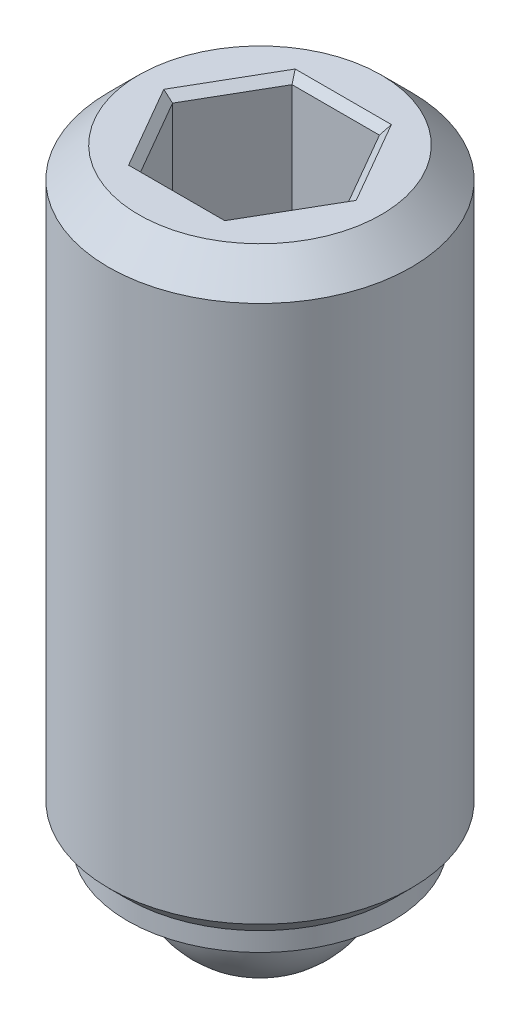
ISO-10303-21;
HEADER;
FILE_DESCRIPTION(('STEP AP214'),'2;1');
FILE_NAME('part.step','',(''),(''),'','','');
FILE_SCHEMA(('AUTOMOTIVE_DESIGN { 1 0 10303 214 1 1 1 1 }'));
ENDSEC;
DATA;
#1=APPLICATION_CONTEXT('core data for automotive mechanical design processes');
#2=APPLICATION_PROTOCOL_DEFINITION('international standard','automotive_design',2000,#1);
#3=PRODUCT_CONTEXT('',#1,'mechanical');
#4=PRODUCT('Part','Part','',(#3));
#5=PRODUCT_RELATED_PRODUCT_CATEGORY('part','',(#4));
#6=PRODUCT_DEFINITION_FORMATION('','',#4);
#7=PRODUCT_DEFINITION_CONTEXT('part definition',#1,'design');
#8=PRODUCT_DEFINITION('design','',#6,#7);
#9=PRODUCT_DEFINITION_SHAPE('','',#8);
#10=(LENGTH_UNIT() NAMED_UNIT(*) SI_UNIT(.MILLI.,.METRE.));
#11=(NAMED_UNIT(*) PLANE_ANGLE_UNIT() SI_UNIT($,.RADIAN.));
#12=(NAMED_UNIT(*) SI_UNIT($,.STERADIAN.) SOLID_ANGLE_UNIT());
#13=UNCERTAINTY_MEASURE_WITH_UNIT(LENGTH_MEASURE(1.E-05),#10,'distance_accuracy_value','');
#14=(GEOMETRIC_REPRESENTATION_CONTEXT(3) GLOBAL_UNCERTAINTY_ASSIGNED_CONTEXT((#13)) GLOBAL_UNIT_ASSIGNED_CONTEXT((#10,
#11,#12)) REPRESENTATION_CONTEXT('',''));
#15=CARTESIAN_POINT('',(0.,0.,0.));
#16=DIRECTION('',(0.,0.,1.));
#17=DIRECTION('',(1.,0.,0.));
#18=AXIS2_PLACEMENT_3D('',#15,#16,#17);
#19=CARTESIAN_POINT('',(3.5,0.,0.));
#20=DIRECTION('',(0.,-1.,0.));
#21=DIRECTION('',(0.,0.,-1.));
#22=AXIS2_PLACEMENT_3D('',#19,#20,#21);
#23=PLANE('',#22);
#24=CARTESIAN_POINT('',(0.,0.,0.));
#25=DIRECTION('',(0.,-1.,0.));
#26=DIRECTION('',(0.,0.,-1.));
#27=AXIS2_PLACEMENT_3D('',#24,#25,#26);
#28=CIRCLE('',#27,2.5);
#29=CARTESIAN_POINT('',(0.,0.,-2.5));
#30=VERTEX_POINT('',#29);
#31=EDGE_CURVE('E168',#30,#30,#28,.T.);
#32=ORIENTED_EDGE('',*,*,#31,.F.);
#33=EDGE_LOOP('',(#32));
#34=FACE_BOUND('',#33,.T.);
#35=CARTESIAN_POINT('',(0.,0.,0.));
#36=DIRECTION('',(0.,-1.,0.));
#37=DIRECTION('',(0.,0.,-1.));
#38=AXIS2_PLACEMENT_3D('',#35,#36,#37);
#39=CIRCLE('',#38,3.5);
#40=CARTESIAN_POINT('',(0.,0.,-3.5));
#41=VERTEX_POINT('',#40);
#42=EDGE_CURVE('E154',#41,#41,#39,.T.);
#43=ORIENTED_EDGE('',*,*,#42,.T.);
#44=EDGE_LOOP('',(#43));
#45=FACE_BOUND('',#44,.T.);
#46=ADVANCED_FACE('F43',(#34,#45),#23,.T.);
#47=CARTESIAN_POINT('',(0.,16.,0.));
#48=DIRECTION('',(0.,1.,0.));
#49=DIRECTION('',(0.,0.,1.));
#50=AXIS2_PLACEMENT_3D('',#47,#48,#49);
#51=PLANE('',#50);
#52=DIRECTION('',(1.,0.,0.));
#53=VECTOR('',#52,1.);
#54=CARTESIAN_POINT('',(1.15470053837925,16.,-2.19999999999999));
#55=LINE('',#54,#53);
#56=CARTESIAN_POINT('',(-1.27017059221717,16.,-2.19999999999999));
#57=VERTEX_POINT('',#56);
#58=CARTESIAN_POINT('',(1.27017059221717,16.,-2.19999999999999));
#59=VERTEX_POINT('',#58);
#60=EDGE_CURVE('E190',#57,#59,#55,.T.);
#61=ORIENTED_EDGE('',*,*,#60,.T.);
#62=DIRECTION('',(0.5,0.,0.866025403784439));
#63=VECTOR('',#62,1.);
#64=CARTESIAN_POINT('',(2.48260615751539,16.,-0.0999999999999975));
#65=LINE('',#64,#63);
#66=CARTESIAN_POINT('',(2.54034118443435,16.,0.));
#67=VERTEX_POINT('',#66);
#68=EDGE_CURVE('E192',#59,#67,#65,.T.);
#69=ORIENTED_EDGE('',*,*,#68,.T.);
#70=DIRECTION('',(-0.499999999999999,0.,0.866025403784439));
#71=VECTOR('',#70,1.);
#72=CARTESIAN_POINT('',(1.32790561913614,16.,2.1));
#73=LINE('',#72,#71);
#74=CARTESIAN_POINT('',(1.27017059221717,16.,2.19999999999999));
#75=VERTEX_POINT('',#74);
#76=EDGE_CURVE('E182',#67,#75,#73,.T.);
#77=ORIENTED_EDGE('',*,*,#76,.T.);
#78=DIRECTION('',(-1.,0.,0.));
#79=VECTOR('',#78,1.);
#80=CARTESIAN_POINT('',(-1.15470053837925,16.,2.19999999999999));
#81=LINE('',#80,#79);
#82=CARTESIAN_POINT('',(-1.27017059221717,16.,2.19999999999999));
#83=VERTEX_POINT('',#82);
#84=EDGE_CURVE('E184',#75,#83,#81,.T.);
#85=ORIENTED_EDGE('',*,*,#84,.T.);
#86=DIRECTION('',(-0.5,0.,-0.866025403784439));
#87=VECTOR('',#86,1.);
#88=CARTESIAN_POINT('',(-2.48260615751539,16.,0.0999999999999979));
#89=LINE('',#88,#87);
#90=CARTESIAN_POINT('',(-2.54034118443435,16.,0.));
#91=VERTEX_POINT('',#90);
#92=EDGE_CURVE('E186',#83,#91,#89,.T.);
#93=ORIENTED_EDGE('',*,*,#92,.T.);
#94=DIRECTION('',(0.5,0.,-0.866025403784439));
#95=VECTOR('',#94,1.);
#96=CARTESIAN_POINT('',(-1.32790561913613,16.,-2.1));
#97=LINE('',#96,#95);
#98=EDGE_CURVE('E188',#91,#57,#97,.T.);
#99=ORIENTED_EDGE('',*,*,#98,.T.);
#100=EDGE_LOOP('',(#61,#69,#77,#85,#93,#99));
#101=FACE_BOUND('',#100,.T.);
#102=CARTESIAN_POINT('',(0.,16.,0.));
#103=DIRECTION('',(0.,1.,0.));
#104=DIRECTION('',(0.,0.,1.));
#105=AXIS2_PLACEMENT_3D('',#102,#103,#104);
#106=CIRCLE('',#105,3.2);
#107=CARTESIAN_POINT('',(0.,16.,-3.2));
#108=VERTEX_POINT('',#107);
#109=EDGE_CURVE('E174',#108,#108,#106,.T.);
#110=ORIENTED_EDGE('',*,*,#109,.T.);
#111=EDGE_LOOP('',(#110));
#112=FACE_BOUND('',#111,.T.);
#113=ADVANCED_FACE('F252',(#101,#112),#51,.T.);
#114=CARTESIAN_POINT('',(0.,0.,0.));
#115=DIRECTION('',(0.,-1.,0.));
#116=DIRECTION('',(0.,0.,-1.));
#117=AXIS2_PLACEMENT_3D('',#114,#115,#116);
#118=CYLINDRICAL_SURFACE('',#117,4.);
#119=CARTESIAN_POINT('',(0.,1.,0.));
#120=DIRECTION('',(0.,-1.,0.));
#121=DIRECTION('',(0.,0.,-1.));
#122=AXIS2_PLACEMENT_3D('',#119,#120,#121);
#123=CIRCLE('',#122,4.);
#124=CARTESIAN_POINT('',(0.,1.,-4.));
#125=VERTEX_POINT('',#124);
#126=EDGE_CURVE('E177',#125,#125,#123,.F.);
#127=ORIENTED_EDGE('',*,*,#126,.T.);
#128=EDGE_LOOP('',(#127));
#129=FACE_BOUND('',#128,.T.);
#130=CARTESIAN_POINT('',(0.,15.2,0.));
#131=DIRECTION('',(0.,1.,0.));
#132=DIRECTION('',(0.,0.,1.));
#133=AXIS2_PLACEMENT_3D('',#130,#131,#132);
#134=CIRCLE('',#133,4.);
#135=CARTESIAN_POINT('',(0.,15.2,-4.));
#136=VERTEX_POINT('',#135);
#137=EDGE_CURVE('E171',#136,#136,#134,.F.);
#138=ORIENTED_EDGE('',*,*,#137,.T.);
#139=EDGE_LOOP('',(#138));
#140=FACE_BOUND('',#139,.T.);
#141=ADVANCED_FACE('F258',(#129,#140),#118,.T.);
#142=CARTESIAN_POINT('',(0.,0.,0.));
#143=DIRECTION('',(0.,-1.,0.));
#144=DIRECTION('',(0.,0.,-1.));
#145=AXIS2_PLACEMENT_3D('',#142,#143,#144);
#146=CYLINDRICAL_SURFACE('',#145,3.5);
#147=CARTESIAN_POINT('',(0.,0.5,0.));
#148=DIRECTION('',(0.,-1.,0.));
#149=DIRECTION('',(0.,0.,-1.));
#150=AXIS2_PLACEMENT_3D('',#147,#148,#149);
#151=CIRCLE('',#150,3.5);
#152=CARTESIAN_POINT('',(0.,0.5,-3.5));
#153=VERTEX_POINT('',#152);
#154=EDGE_CURVE('E165',#153,#153,#151,.T.);
#155=ORIENTED_EDGE('',*,*,#154,.T.);
#156=EDGE_LOOP('',(#155));
#157=FACE_BOUND('',#156,.T.);
#158=ORIENTED_EDGE('',*,*,#42,.F.);
#159=EDGE_LOOP('',(#158));
#160=FACE_BOUND('',#159,.T.);
#161=ADVANCED_FACE('F322',(#157,#160),#146,.T.);
#162=CARTESIAN_POINT('',(0.,0.,0.));
#163=DIRECTION('',(0.,-1.,0.));
#164=DIRECTION('',(-1.,0.,0.));
#165=AXIS2_PLACEMENT_3D('',#162,#163,#164);
#166=SPHERICAL_SURFACE('',#165,2.5);
#167=ORIENTED_EDGE('',*,*,#31,.T.);
#168=EDGE_LOOP('',(#167));
#169=FACE_BOUND('',#168,.T.);
#170=ADVANCED_FACE('F272',(#169),#166,.T.);
#171=CARTESIAN_POINT('',(0.,15.2,0.));
#172=DIRECTION('',(0.,-1.,0.));
#173=DIRECTION('',(0.,0.,-1.));
#174=AXIS2_PLACEMENT_3D('',#171,#172,#173);
#175=CONICAL_SURFACE('',#174,4.,0.785398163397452);
#176=CARTESIAN_POINT('',(0.,16.,-3.2));
#177=CARTESIAN_POINT('',(0.,15.9916666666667,-3.20833333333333));
#178=CARTESIAN_POINT('',(0.,15.9833333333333,-3.21666666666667));
#179=CARTESIAN_POINT('',(0.,15.9666666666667,-3.23333333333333));
#180=CARTESIAN_POINT('',(0.,15.9583333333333,-3.24166666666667));
#181=CARTESIAN_POINT('',(0.,15.9416666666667,-3.25833333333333));
#182=CARTESIAN_POINT('',(0.,15.9333333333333,-3.26666666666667));
#183=CARTESIAN_POINT('',(0.,15.9166666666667,-3.28333333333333));
#184=CARTESIAN_POINT('',(0.,15.9083333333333,-3.29166666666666));
#185=CARTESIAN_POINT('',(0.,15.8916666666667,-3.30833333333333));
#186=CARTESIAN_POINT('',(0.,15.8833333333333,-3.31666666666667));
#187=CARTESIAN_POINT('',(0.,15.8666666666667,-3.33333333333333));
#188=CARTESIAN_POINT('',(0.,15.8583333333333,-3.34166666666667));
#189=CARTESIAN_POINT('',(0.,15.8416666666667,-3.35833333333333));
#190=CARTESIAN_POINT('',(0.,15.8333333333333,-3.36666666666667));
#191=CARTESIAN_POINT('',(0.,15.8166666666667,-3.38333333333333));
#192=CARTESIAN_POINT('',(0.,15.8083333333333,-3.39166666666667));
#193=CARTESIAN_POINT('',(0.,15.7916666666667,-3.40833333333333));
#194=CARTESIAN_POINT('',(0.,15.7833333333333,-3.41666666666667));
#195=CARTESIAN_POINT('',(0.,15.7666666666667,-3.43333333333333));
#196=CARTESIAN_POINT('',(0.,15.7583333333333,-3.44166666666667));
#197=CARTESIAN_POINT('',(0.,15.7416666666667,-3.45833333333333));
#198=CARTESIAN_POINT('',(0.,15.7333333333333,-3.46666666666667));
#199=CARTESIAN_POINT('',(0.,15.7166666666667,-3.48333333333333));
#200=CARTESIAN_POINT('',(0.,15.7083333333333,-3.49166666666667));
#201=CARTESIAN_POINT('',(0.,15.6916666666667,-3.50833333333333));
#202=CARTESIAN_POINT('',(0.,15.6833333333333,-3.51666666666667));
#203=CARTESIAN_POINT('',(0.,15.6666666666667,-3.53333333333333));
#204=CARTESIAN_POINT('',(0.,15.6583333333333,-3.54166666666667));
#205=CARTESIAN_POINT('',(0.,15.6416666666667,-3.55833333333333));
#206=CARTESIAN_POINT('',(0.,15.6333333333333,-3.56666666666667));
#207=CARTESIAN_POINT('',(0.,15.6166666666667,-3.58333333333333));
#208=CARTESIAN_POINT('',(0.,15.6083333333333,-3.59166666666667));
#209=CARTESIAN_POINT('',(0.,15.5916666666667,-3.60833333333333));
#210=CARTESIAN_POINT('',(0.,15.5833333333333,-3.61666666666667));
#211=CARTESIAN_POINT('',(0.,15.5666666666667,-3.63333333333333));
#212=CARTESIAN_POINT('',(0.,15.5583333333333,-3.64166666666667));
#213=CARTESIAN_POINT('',(0.,15.5416666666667,-3.65833333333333));
#214=CARTESIAN_POINT('',(0.,15.5333333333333,-3.66666666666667));
#215=CARTESIAN_POINT('',(0.,15.5166666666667,-3.68333333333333));
#216=CARTESIAN_POINT('',(0.,15.5083333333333,-3.69166666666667));
#217=CARTESIAN_POINT('',(0.,15.4916666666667,-3.70833333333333));
#218=CARTESIAN_POINT('',(0.,15.4833333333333,-3.71666666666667));
#219=CARTESIAN_POINT('',(0.,15.4666666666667,-3.73333333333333));
#220=CARTESIAN_POINT('',(0.,15.4583333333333,-3.74166666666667));
#221=CARTESIAN_POINT('',(0.,15.4416666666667,-3.75833333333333));
#222=CARTESIAN_POINT('',(0.,15.4333333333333,-3.76666666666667));
#223=CARTESIAN_POINT('',(0.,15.4166666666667,-3.78333333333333));
#224=CARTESIAN_POINT('',(0.,15.4083333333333,-3.79166666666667));
#225=CARTESIAN_POINT('',(0.,15.3916666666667,-3.80833333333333));
#226=CARTESIAN_POINT('',(0.,15.3833333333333,-3.81666666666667));
#227=CARTESIAN_POINT('',(0.,15.3666666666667,-3.83333333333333));
#228=CARTESIAN_POINT('',(0.,15.3583333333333,-3.84166666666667));
#229=CARTESIAN_POINT('',(0.,15.3416666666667,-3.85833333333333));
#230=CARTESIAN_POINT('',(0.,15.3333333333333,-3.86666666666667));
#231=CARTESIAN_POINT('',(0.,15.3166666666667,-3.88333333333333));
#232=CARTESIAN_POINT('',(0.,15.3083333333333,-3.89166666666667));
#233=CARTESIAN_POINT('',(0.,15.2916666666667,-3.90833333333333));
#234=CARTESIAN_POINT('',(0.,15.2833333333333,-3.91666666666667));
#235=CARTESIAN_POINT('',(0.,15.2666666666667,-3.93333333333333));
#236=CARTESIAN_POINT('',(0.,15.2583333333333,-3.94166666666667));
#237=CARTESIAN_POINT('',(0.,15.2416666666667,-3.95833333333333));
#238=CARTESIAN_POINT('',(0.,15.2333333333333,-3.96666666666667));
#239=CARTESIAN_POINT('',(0.,15.2166666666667,-3.98333333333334));
#240=CARTESIAN_POINT('',(0.,15.2083333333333,-3.99166666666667));
#241=CARTESIAN_POINT('',(0.,15.2,-4.));
#242=B_SPLINE_CURVE_WITH_KNOTS('',3,(#176,#177,#178,#179,#180,#181,#182,#183,#184,#185,#186,
#187,#188,#189,#190,#191,#192,#193,#194,#195,#196,#197,#198,#199,#200,#201,#202,#203,#204,#205,
#206,#207,#208,#209,#210,#211,#212,#213,#214,#215,#216,#217,#218,#219,#220,#221,#222,#223,#224,
#225,#226,#227,#228,#229,#230,#231,#232,#233,#234,#235,#236,#237,#238,#239,#240,#241),
.UNSPECIFIED.,.F.,.F.,(4,2,2,2,2,2,2,2,2,2,2,2,2,2,2,2,2,2,2,2,2,2,2,2,2,2,2,2,2,2,2,2,4),(0.,
0.0353553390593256,0.0707106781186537,0.106066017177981,0.141421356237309,0.176776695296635,
0.212132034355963,0.247487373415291,0.282842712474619,0.318198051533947,0.353553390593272,
0.3889087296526,0.424264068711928,0.459619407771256,0.494974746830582,0.530330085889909,
0.565685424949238,0.601040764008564,0.636396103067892,0.671751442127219,0.707106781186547,
0.742462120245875,0.777817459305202,0.81317279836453,0.848528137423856,0.883883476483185,
0.919238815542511,0.954594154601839,0.989949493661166,1.02530483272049,1.06066017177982,
1.09601551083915,1.13137084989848),.UNSPECIFIED.);
#243=EDGE_CURVE('BSEAM266',#108,#136,#242,.T.);
#244=ORIENTED_EDGE('',*,*,#109,.F.);
#245=ORIENTED_EDGE('',*,*,#137,.F.);
#246=ORIENTED_EDGE('',*,*,#243,.T.);
#247=ORIENTED_EDGE('',*,*,#243,.F.);
#248=EDGE_LOOP('',(#244,#246,#245,#247));
#249=FACE_BOUND('',#248,.T.);
#250=ADVANCED_FACE('F266',(#249),#175,.T.);
#251=CARTESIAN_POINT('',(0.,0.5,0.));
#252=DIRECTION('',(0.,1.,0.));
#253=DIRECTION('',(0.,0.,1.));
#254=AXIS2_PLACEMENT_3D('',#251,#252,#253);
#255=CONICAL_SURFACE('',#254,3.5,0.785398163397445);
#256=ORIENTED_EDGE('',*,*,#126,.F.);
#257=EDGE_LOOP('',(#256));
#258=FACE_BOUND('',#257,.T.);
#259=ORIENTED_EDGE('',*,*,#154,.F.);
#260=EDGE_LOOP('',(#259));
#261=FACE_BOUND('',#260,.T.);
#262=ADVANCED_FACE('F248',(#258,#261),#255,.T.);
#263=CARTESIAN_POINT('',(1.15470053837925,12.,2.));
#264=DIRECTION('',(0.866025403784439,0.,0.5));
#265=DIRECTION('',(0.499999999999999,0.,-0.866025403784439));
#266=AXIS2_PLACEMENT_3D('',#263,#264,#265);
#267=PLANE('',#266);
#268=DIRECTION('',(0.,1.,0.));
#269=VECTOR('',#268,1.);
#270=CARTESIAN_POINT('',(1.15470053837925,12.,2.));
#271=LINE('',#270,#269);
#272=CARTESIAN_POINT('',(1.15470053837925,12.,2.));
#273=VERTEX_POINT('',#272);
#274=CARTESIAN_POINT('',(1.15470053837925,15.8,2.));
#275=VERTEX_POINT('',#274);
#276=EDGE_CURVE('E152',#273,#275,#271,.T.);
#277=ORIENTED_EDGE('',*,*,#276,.T.);
#278=DIRECTION('',(0.499999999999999,0.,-0.866025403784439));
#279=VECTOR('',#278,1.);
#280=CARTESIAN_POINT('',(2.3094010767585,15.8,0.));
#281=LINE('',#280,#279);
#282=CARTESIAN_POINT('',(2.3094010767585,15.8,0.));
#283=VERTEX_POINT('',#282);
#284=EDGE_CURVE('E11',#275,#283,#281,.T.);
#285=ORIENTED_EDGE('',*,*,#284,.T.);
#286=DIRECTION('',(0.,1.,0.));
#287=VECTOR('',#286,1.);
#288=CARTESIAN_POINT('',(2.3094010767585,12.,0.));
#289=LINE('',#288,#287);
#290=CARTESIAN_POINT('',(2.3094010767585,12.,0.));
#291=VERTEX_POINT('',#290);
#292=EDGE_CURVE('E116',#291,#283,#289,.T.);
#293=ORIENTED_EDGE('',*,*,#292,.F.);
#294=DIRECTION('',(0.499999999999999,0.,-0.866025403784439));
#295=VECTOR('',#294,1.);
#296=CARTESIAN_POINT('',(1.15470053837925,12.,2.));
#297=LINE('',#296,#295);
#298=EDGE_CURVE('E120',#273,#291,#297,.T.);
#299=ORIENTED_EDGE('',*,*,#298,.F.);
#300=EDGE_LOOP('',(#277,#285,#293,#299));
#301=FACE_BOUND('',#300,.T.);
#302=ADVANCED_FACE('F118',(#301),#267,.F.);
#303=CARTESIAN_POINT('',(-1.15470053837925,12.,2.));
#304=DIRECTION('',(0.,0.,1.));
#305=DIRECTION('',(1.,0.,0.));
#306=AXIS2_PLACEMENT_3D('',#303,#304,#305);
#307=PLANE('',#306);
#308=DIRECTION('',(0.,1.,0.));
#309=VECTOR('',#308,1.);
#310=CARTESIAN_POINT('',(-1.15470053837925,12.,2.));
#311=LINE('',#310,#309);
#312=CARTESIAN_POINT('',(-1.15470053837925,12.,2.));
#313=VERTEX_POINT('',#312);
#314=CARTESIAN_POINT('',(-1.15470053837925,15.8,2.));
#315=VERTEX_POINT('',#314);
#316=EDGE_CURVE('E155',#313,#315,#311,.T.);
#317=ORIENTED_EDGE('',*,*,#316,.T.);
#318=DIRECTION('',(1.,0.,0.));
#319=VECTOR('',#318,1.);
#320=CARTESIAN_POINT('',(1.15470053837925,15.8,2.));
#321=LINE('',#320,#319);
#322=EDGE_CURVE('E53',#315,#275,#321,.T.);
#323=ORIENTED_EDGE('',*,*,#322,.T.);
#324=ORIENTED_EDGE('',*,*,#276,.F.);
#325=DIRECTION('',(1.,0.,0.));
#326=VECTOR('',#325,1.);
#327=CARTESIAN_POINT('',(-1.15470053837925,12.,2.));
#328=LINE('',#327,#326);
#329=EDGE_CURVE('E127',#313,#273,#328,.T.);
#330=ORIENTED_EDGE('',*,*,#329,.F.);
#331=EDGE_LOOP('',(#317,#323,#324,#330));
#332=FACE_BOUND('',#331,.T.);
#333=ADVANCED_FACE('F240',(#332),#307,.F.);
#334=CARTESIAN_POINT('',(-2.3094010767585,12.,0.));
#335=DIRECTION('',(-0.866025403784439,0.,0.5));
#336=DIRECTION('',(0.5,0.,0.866025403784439));
#337=AXIS2_PLACEMENT_3D('',#334,#335,#336);
#338=PLANE('',#337);
#339=DIRECTION('',(0.,1.,0.));
#340=VECTOR('',#339,1.);
#341=CARTESIAN_POINT('',(-2.3094010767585,12.,0.));
#342=LINE('',#341,#340);
#343=CARTESIAN_POINT('',(-2.3094010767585,12.,0.));
#344=VERTEX_POINT('',#343);
#345=CARTESIAN_POINT('',(-2.3094010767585,15.8,0.));
#346=VERTEX_POINT('',#345);
#347=EDGE_CURVE('E157',#344,#346,#342,.T.);
#348=ORIENTED_EDGE('',*,*,#347,.T.);
#349=DIRECTION('',(0.5,0.,0.866025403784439));
#350=VECTOR('',#349,1.);
#351=CARTESIAN_POINT('',(-1.15470053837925,15.8,2.));
#352=LINE('',#351,#350);
#353=EDGE_CURVE('E68',#346,#315,#352,.T.);
#354=ORIENTED_EDGE('',*,*,#353,.T.);
#355=ORIENTED_EDGE('',*,*,#316,.F.);
#356=DIRECTION('',(0.5,0.,0.866025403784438));
#357=VECTOR('',#356,1.);
#358=CARTESIAN_POINT('',(-2.3094010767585,12.,0.));
#359=LINE('',#358,#357);
#360=EDGE_CURVE('E149',#344,#313,#359,.T.);
#361=ORIENTED_EDGE('',*,*,#360,.F.);
#362=EDGE_LOOP('',(#348,#354,#355,#361));
#363=FACE_BOUND('',#362,.T.);
#364=ADVANCED_FACE('F239',(#363),#338,.F.);
#365=CARTESIAN_POINT('',(-1.15470053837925,12.,-2.));
#366=DIRECTION('',(-0.866025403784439,0.,-0.5));
#367=DIRECTION('',(-0.5,0.,0.866025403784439));
#368=AXIS2_PLACEMENT_3D('',#365,#366,#367);
#369=PLANE('',#368);
#370=DIRECTION('',(0.,1.,0.));
#371=VECTOR('',#370,1.);
#372=CARTESIAN_POINT('',(-1.15470053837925,12.,-2.));
#373=LINE('',#372,#371);
#374=CARTESIAN_POINT('',(-1.15470053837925,12.,-2.));
#375=VERTEX_POINT('',#374);
#376=CARTESIAN_POINT('',(-1.15470053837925,15.8,-2.));
#377=VERTEX_POINT('',#376);
#378=EDGE_CURVE('E159',#375,#377,#373,.T.);
#379=ORIENTED_EDGE('',*,*,#378,.T.);
#380=DIRECTION('',(-0.5,0.,0.866025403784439));
#381=VECTOR('',#380,1.);
#382=CARTESIAN_POINT('',(-2.3094010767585,15.8,0.));
#383=LINE('',#382,#381);
#384=EDGE_CURVE('E197',#377,#346,#383,.T.);
#385=ORIENTED_EDGE('',*,*,#384,.T.);
#386=ORIENTED_EDGE('',*,*,#347,.F.);
#387=DIRECTION('',(-0.5,0.,0.866025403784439));
#388=VECTOR('',#387,1.);
#389=CARTESIAN_POINT('',(-1.15470053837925,12.,-2.));
#390=LINE('',#389,#388);
#391=EDGE_CURVE('E146',#375,#344,#390,.T.);
#392=ORIENTED_EDGE('',*,*,#391,.F.);
#393=EDGE_LOOP('',(#379,#385,#386,#392));
#394=FACE_BOUND('',#393,.T.);
#395=ADVANCED_FACE('F238',(#394),#369,.F.);
#396=CARTESIAN_POINT('',(1.15470053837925,12.,-2.));
#397=DIRECTION('',(0.,0.,-1.));
#398=DIRECTION('',(-1.,0.,0.));
#399=AXIS2_PLACEMENT_3D('',#396,#397,#398);
#400=PLANE('',#399);
#401=DIRECTION('',(0.,1.,0.));
#402=VECTOR('',#401,1.);
#403=CARTESIAN_POINT('',(1.15470053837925,12.,-2.));
#404=LINE('',#403,#402);
#405=CARTESIAN_POINT('',(1.15470053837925,12.,-2.));
#406=VERTEX_POINT('',#405);
#407=CARTESIAN_POINT('',(1.15470053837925,15.8,-2.));
#408=VERTEX_POINT('',#407);
#409=EDGE_CURVE('E126',#406,#408,#404,.T.);
#410=ORIENTED_EDGE('',*,*,#409,.T.);
#411=DIRECTION('',(-1.,0.,0.));
#412=VECTOR('',#411,1.);
#413=CARTESIAN_POINT('',(-1.15470053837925,15.8,-2.));
#414=LINE('',#413,#412);
#415=EDGE_CURVE('E195',#408,#377,#414,.T.);
#416=ORIENTED_EDGE('',*,*,#415,.T.);
#417=ORIENTED_EDGE('',*,*,#378,.F.);
#418=DIRECTION('',(-1.,0.,0.));
#419=VECTOR('',#418,1.);
#420=CARTESIAN_POINT('',(1.15470053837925,12.,-2.));
#421=LINE('',#420,#419);
#422=EDGE_CURVE('E136',#406,#375,#421,.T.);
#423=ORIENTED_EDGE('',*,*,#422,.F.);
#424=EDGE_LOOP('',(#410,#416,#417,#423));
#425=FACE_BOUND('',#424,.T.);
#426=ADVANCED_FACE('F234',(#425),#400,.F.);
#427=CARTESIAN_POINT('',(2.3094010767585,12.,0.));
#428=DIRECTION('',(0.866025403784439,0.,-0.5));
#429=DIRECTION('',(-0.5,0.,-0.866025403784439));
#430=AXIS2_PLACEMENT_3D('',#427,#428,#429);
#431=PLANE('',#430);
#432=ORIENTED_EDGE('',*,*,#292,.T.);
#433=DIRECTION('',(-0.5,0.,-0.866025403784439));
#434=VECTOR('',#433,1.);
#435=CARTESIAN_POINT('',(1.15470053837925,15.8,-2.));
#436=LINE('',#435,#434);
#437=EDGE_CURVE('E180',#283,#408,#436,.T.);
#438=ORIENTED_EDGE('',*,*,#437,.T.);
#439=ORIENTED_EDGE('',*,*,#409,.F.);
#440=DIRECTION('',(-0.5,0.,-0.866025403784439));
#441=VECTOR('',#440,1.);
#442=CARTESIAN_POINT('',(2.3094010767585,12.,0.));
#443=LINE('',#442,#441);
#444=EDGE_CURVE('E130',#291,#406,#443,.T.);
#445=ORIENTED_EDGE('',*,*,#444,.F.);
#446=EDGE_LOOP('',(#432,#438,#439,#445));
#447=FACE_BOUND('',#446,.T.);
#448=ADVANCED_FACE('F131',(#447),#431,.F.);
#449=CARTESIAN_POINT('',(0.,12.,0.));
#450=DIRECTION('',(0.,1.,0.));
#451=DIRECTION('',(0.,0.,1.));
#452=AXIS2_PLACEMENT_3D('',#449,#450,#451);
#453=PLANE('',#452);
#454=ORIENTED_EDGE('',*,*,#298,.T.);
#455=ORIENTED_EDGE('',*,*,#444,.T.);
#456=ORIENTED_EDGE('',*,*,#422,.T.);
#457=ORIENTED_EDGE('',*,*,#391,.T.);
#458=ORIENTED_EDGE('',*,*,#360,.T.);
#459=ORIENTED_EDGE('',*,*,#329,.T.);
#460=EDGE_LOOP('',(#454,#455,#456,#457,#458,#459));
#461=FACE_BOUND('',#460,.T.);
#462=ADVANCED_FACE('F138',(#461),#453,.T.);
#463=CARTESIAN_POINT('',(-2.3094010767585,15.8,0.));
#464=DIRECTION('',(0.612372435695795,0.707106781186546,-0.353553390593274));
#465=DIRECTION('',(-0.5,0.,-0.866025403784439));
#466=AXIS2_PLACEMENT_3D('',#463,#464,#465);
#467=PLANE('',#466);
#468=DIRECTION('',(-0.755928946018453,0.654653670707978,0.));
#469=VECTOR('',#468,1.);
#470=CARTESIAN_POINT('',(-1.64957219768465,15.2285714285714,0.));
#471=LINE('',#470,#469);
#472=EDGE_CURVE('E143',#91,#346,#471,.F.);
#473=ORIENTED_EDGE('',*,*,#472,.F.);
#474=ORIENTED_EDGE('',*,*,#92,.F.);
#475=DIRECTION('',(-0.377964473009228,0.654653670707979,0.654653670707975));
#476=VECTOR('',#475,1.);
#477=CARTESIAN_POINT('',(-0.824786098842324,15.2285714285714,1.42857142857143));
#478=LINE('',#477,#476);
#479=EDGE_CURVE('E48',#315,#83,#478,.T.);
#480=ORIENTED_EDGE('',*,*,#479,.F.);
#481=ORIENTED_EDGE('',*,*,#353,.F.);
#482=EDGE_LOOP('',(#473,#474,#480,#481));
#483=FACE_BOUND('',#482,.T.);
#484=ADVANCED_FACE('F46',(#483),#467,.T.);
#485=CARTESIAN_POINT('',(-1.15470053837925,15.8,2.));
#486=DIRECTION('',(0.,0.707106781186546,-0.707106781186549));
#487=DIRECTION('',(-1.,0.,0.));
#488=AXIS2_PLACEMENT_3D('',#485,#486,#487);
#489=PLANE('',#488);
#490=ORIENTED_EDGE('',*,*,#479,.T.);
#491=ORIENTED_EDGE('',*,*,#84,.F.);
#492=DIRECTION('',(0.377964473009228,0.654653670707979,0.654653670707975));
#493=VECTOR('',#492,1.);
#494=CARTESIAN_POINT('',(0.824786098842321,15.2285714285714,1.42857142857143));
#495=LINE('',#494,#493);
#496=EDGE_CURVE('E208',#275,#75,#495,.T.);
#497=ORIENTED_EDGE('',*,*,#496,.F.);
#498=ORIENTED_EDGE('',*,*,#322,.F.);
#499=EDGE_LOOP('',(#490,#491,#497,#498));
#500=FACE_BOUND('',#499,.T.);
#501=ADVANCED_FACE('F223',(#500),#489,.T.);
#502=CARTESIAN_POINT('',(-1.15470053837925,15.8,-2.));
#503=DIRECTION('',(0.612372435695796,0.707106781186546,0.353553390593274));
#504=DIRECTION('',(0.5,0.,-0.866025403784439));
#505=AXIS2_PLACEMENT_3D('',#502,#503,#504);
#506=PLANE('',#505);
#507=ORIENTED_EDGE('',*,*,#472,.T.);
#508=ORIENTED_EDGE('',*,*,#384,.F.);
#509=DIRECTION('',(-0.377964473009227,0.654653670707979,-0.654653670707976));
#510=VECTOR('',#509,1.);
#511=CARTESIAN_POINT('',(-0.824786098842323,15.2285714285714,-1.42857142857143));
#512=LINE('',#511,#510);
#513=EDGE_CURVE('E205',#57,#377,#512,.F.);
#514=ORIENTED_EDGE('',*,*,#513,.F.);
#515=ORIENTED_EDGE('',*,*,#98,.F.);
#516=EDGE_LOOP('',(#507,#508,#514,#515));
#517=FACE_BOUND('',#516,.T.);
#518=ADVANCED_FACE('F215',(#517),#506,.T.);
#519=CARTESIAN_POINT('',(1.15470053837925,15.8,2.));
#520=DIRECTION('',(-0.612372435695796,0.707106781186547,-0.353553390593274));
#521=DIRECTION('',(-0.499999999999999,0.,0.866025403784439));
#522=AXIS2_PLACEMENT_3D('',#519,#520,#521);
#523=PLANE('',#522);
#524=ORIENTED_EDGE('',*,*,#496,.T.);
#525=ORIENTED_EDGE('',*,*,#76,.F.);
#526=DIRECTION('',(-0.755928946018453,-0.654653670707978,0.));
#527=VECTOR('',#526,1.);
#528=CARTESIAN_POINT('',(2.3094010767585,15.8,0.));
#529=LINE('',#528,#527);
#530=EDGE_CURVE('E203',#283,#67,#529,.F.);
#531=ORIENTED_EDGE('',*,*,#530,.F.);
#532=ORIENTED_EDGE('',*,*,#284,.F.);
#533=EDGE_LOOP('',(#524,#525,#531,#532));
#534=FACE_BOUND('',#533,.T.);
#535=ADVANCED_FACE('F226',(#534),#523,.T.);
#536=CARTESIAN_POINT('',(1.15470053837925,15.8,-2.));
#537=DIRECTION('',(0.,0.707106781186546,0.707106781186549));
#538=DIRECTION('',(1.,0.,0.));
#539=AXIS2_PLACEMENT_3D('',#536,#537,#538);
#540=PLANE('',#539);
#541=ORIENTED_EDGE('',*,*,#513,.T.);
#542=ORIENTED_EDGE('',*,*,#415,.F.);
#543=DIRECTION('',(0.377964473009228,0.654653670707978,-0.654653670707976));
#544=VECTOR('',#543,1.);
#545=CARTESIAN_POINT('',(0.824786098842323,15.2285714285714,-1.42857142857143));
#546=LINE('',#545,#544);
#547=EDGE_CURVE('E201',#59,#408,#546,.F.);
#548=ORIENTED_EDGE('',*,*,#547,.F.);
#549=ORIENTED_EDGE('',*,*,#60,.F.);
#550=EDGE_LOOP('',(#541,#542,#548,#549));
#551=FACE_BOUND('',#550,.T.);
#552=ADVANCED_FACE('F285',(#551),#540,.T.);
#553=CARTESIAN_POINT('',(2.3094010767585,15.8,0.));
#554=DIRECTION('',(-0.612372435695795,0.707106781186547,0.353553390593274));
#555=DIRECTION('',(0.5,0.,0.866025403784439));
#556=AXIS2_PLACEMENT_3D('',#553,#554,#555);
#557=PLANE('',#556);
#558=ORIENTED_EDGE('',*,*,#530,.T.);
#559=ORIENTED_EDGE('',*,*,#68,.F.);
#560=ORIENTED_EDGE('',*,*,#547,.T.);
#561=ORIENTED_EDGE('',*,*,#437,.F.);
#562=EDGE_LOOP('',(#558,#559,#560,#561));
#563=FACE_BOUND('',#562,.T.);
#564=ADVANCED_FACE('F230',(#563),#557,.T.);
#565=CLOSED_SHELL('',(#46,#113,#141,#161,#170,#250,#262,#302,#333,#364,#395,#426,#448,#462,#484,
#501,#518,#535,#552,#564));
#566=MANIFOLD_SOLID_BREP('B2',#565);
#567=ADVANCED_BREP_SHAPE_REPRESENTATION('',(#18,#566),#14);
#568=SHAPE_DEFINITION_REPRESENTATION(#9,#567);
ENDSEC;
END-ISO-10303-21;
